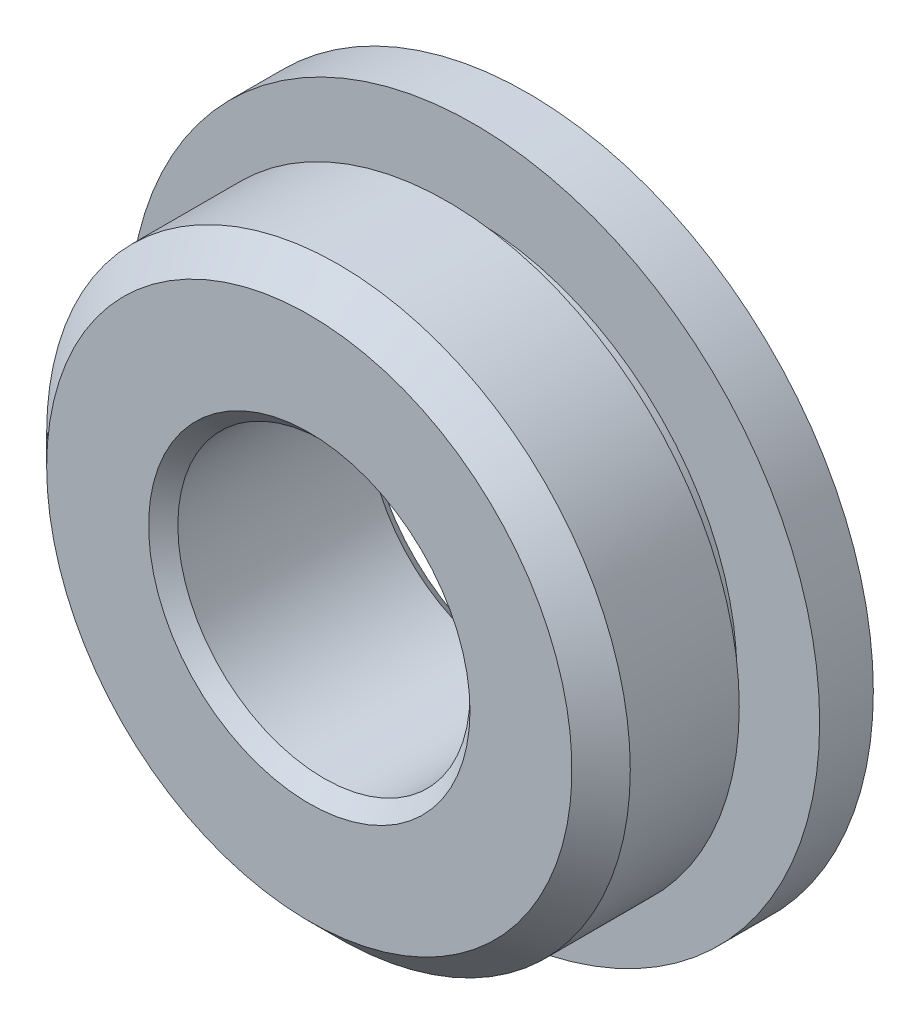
ISO-10303-21;
HEADER;
FILE_DESCRIPTION(('STEP AP214'),'2;1');
FILE_NAME('part.step','',(''),(''),'','','');
FILE_SCHEMA(('AUTOMOTIVE_DESIGN { 1 0 10303 214 1 1 1 1 }'));
ENDSEC;
DATA;
#1=APPLICATION_CONTEXT('core data for automotive mechanical design processes');
#2=APPLICATION_PROTOCOL_DEFINITION('international standard','automotive_design',2000,#1);
#3=PRODUCT_CONTEXT('',#1,'mechanical');
#4=PRODUCT('Part','Part','',(#3));
#5=PRODUCT_RELATED_PRODUCT_CATEGORY('part','',(#4));
#6=PRODUCT_DEFINITION_FORMATION('','',#4);
#7=PRODUCT_DEFINITION_CONTEXT('part definition',#1,'design');
#8=PRODUCT_DEFINITION('design','',#6,#7);
#9=PRODUCT_DEFINITION_SHAPE('','',#8);
#10=(LENGTH_UNIT() NAMED_UNIT(*) SI_UNIT(.MILLI.,.METRE.));
#11=(NAMED_UNIT(*) PLANE_ANGLE_UNIT() SI_UNIT($,.RADIAN.));
#12=(NAMED_UNIT(*) SI_UNIT($,.STERADIAN.) SOLID_ANGLE_UNIT());
#13=UNCERTAINTY_MEASURE_WITH_UNIT(LENGTH_MEASURE(1.E-05),#10,'distance_accuracy_value','');
#14=(GEOMETRIC_REPRESENTATION_CONTEXT(3) GLOBAL_UNCERTAINTY_ASSIGNED_CONTEXT((#13)) GLOBAL_UNIT_ASSIGNED_CONTEXT((#10,
#11,#12)) REPRESENTATION_CONTEXT('',''));
#15=CARTESIAN_POINT('',(0.,0.,0.));
#16=DIRECTION('',(0.,0.,1.));
#17=DIRECTION('',(1.,0.,0.));
#18=AXIS2_PLACEMENT_3D('',#15,#16,#17);
#19=CARTESIAN_POINT('',(0.,0.,-0.118999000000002));
#20=DIRECTION('',(0.,0.,1.));
#21=DIRECTION('',(1.,0.,0.));
#22=AXIS2_PLACEMENT_3D('',#19,#20,#21);
#23=CYLINDRICAL_SURFACE('',#22,3.17627);
#24=CARTESIAN_POINT('',(0.,0.,2.062353));
#25=DIRECTION('',(0.,0.,-1.));
#26=DIRECTION('',(0.,1.,0.));
#27=AXIS2_PLACEMENT_3D('',#24,#25,#26);
#28=CIRCLE('',#27,3.17627);
#29=CARTESIAN_POINT('',(0.,3.17626999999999,2.062353));
#30=VERTEX_POINT('',#29);
#31=EDGE_CURVE('E29',#30,#30,#28,.F.);
#32=ORIENTED_EDGE('',*,*,#31,.F.);
#33=EDGE_LOOP('',(#32));
#34=FACE_BOUND('',#33,.T.);
#35=CARTESIAN_POINT('',(0.,0.,0.8763));
#36=DIRECTION('',(0.,0.,1.));
#37=DIRECTION('',(1.,0.,0.));
#38=AXIS2_PLACEMENT_3D('',#35,#36,#37);
#39=CIRCLE('',#38,3.17627);
#40=CARTESIAN_POINT('',(3.17627,0.,0.8763));
#41=VERTEX_POINT('',#40);
#42=EDGE_CURVE('E17',#41,#41,#39,.T.);
#43=ORIENTED_EDGE('',*,*,#42,.T.);
#44=EDGE_LOOP('',(#43));
#45=FACE_BOUND('',#44,.T.);
#46=ADVANCED_FACE('F14',(#34,#45),#23,.T.);
#47=CARTESIAN_POINT('',(0.,0.,2.062353));
#48=DIRECTION('',(0.,0.,-1.));
#49=DIRECTION('',(-1.,0.,0.));
#50=AXIS2_PLACEMENT_3D('',#47,#48,#49);
#51=CONICAL_SURFACE('',#50,3.17626999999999,0.785398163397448);
#52=CARTESIAN_POINT('',(0.,0.,2.37998));
#53=DIRECTION('',(0.,0.,-1.));
#54=DIRECTION('',(-1.,0.,0.));
#55=AXIS2_PLACEMENT_3D('',#52,#53,#54);
#56=CIRCLE('',#55,2.858643);
#57=CARTESIAN_POINT('',(-2.858643,0.,2.37998));
#58=VERTEX_POINT('',#57);
#59=EDGE_CURVE('E44',#58,#58,#56,.F.);
#60=ORIENTED_EDGE('',*,*,#59,.F.);
#61=EDGE_LOOP('',(#60));
#62=FACE_BOUND('',#61,.T.);
#63=ORIENTED_EDGE('',*,*,#31,.T.);
#64=EDGE_LOOP('',(#63));
#65=FACE_BOUND('',#64,.T.);
#66=ADVANCED_FACE('F54',(#62,#65),#51,.T.);
#67=CARTESIAN_POINT('',(0.,0.,0.8763));
#68=DIRECTION('',(0.,0.,1.));
#69=DIRECTION('',(1.,0.,0.));
#70=AXIS2_PLACEMENT_3D('',#67,#68,#69);
#71=PLANE('',#70);
#72=CARTESIAN_POINT('',(0.,0.,0.8763));
#73=DIRECTION('',(0.,0.,1.));
#74=DIRECTION('',(1.,0.,0.));
#75=AXIS2_PLACEMENT_3D('',#72,#73,#74);
#76=CIRCLE('',#75,2.858643);
#77=CARTESIAN_POINT('',(2.858643,0.,0.8763));
#78=VERTEX_POINT('',#77);
#79=EDGE_CURVE('E42',#78,#78,#76,.F.);
#80=ORIENTED_EDGE('',*,*,#79,.F.);
#81=EDGE_LOOP('',(#80));
#82=FACE_BOUND('',#81,.T.);
#83=ORIENTED_EDGE('',*,*,#42,.F.);
#84=EDGE_LOOP('',(#83));
#85=FACE_BOUND('',#84,.T.);
#86=ADVANCED_FACE('F61',(#82,#85),#71,.F.);
#87=CARTESIAN_POINT('',(0.,0.,2.37998));
#88=DIRECTION('',(0.,0.,1.));
#89=DIRECTION('',(1.,0.,0.));
#90=AXIS2_PLACEMENT_3D('',#87,#88,#89);
#91=PLANE('',#90);
#92=CARTESIAN_POINT('',(0.,0.,2.37998));
#93=DIRECTION('',(0.,0.,1.));
#94=DIRECTION('',(1.,0.,0.));
#95=AXIS2_PLACEMENT_3D('',#92,#93,#94);
#96=CIRCLE('',#95,1.749044);
#97=CARTESIAN_POINT('',(1.749044,0.,2.37998));
#98=VERTEX_POINT('',#97);
#99=EDGE_CURVE('E39',#98,#98,#96,.F.);
#100=ORIENTED_EDGE('',*,*,#99,.T.);
#101=EDGE_LOOP('',(#100));
#102=FACE_BOUND('',#101,.T.);
#103=ORIENTED_EDGE('',*,*,#59,.T.);
#104=EDGE_LOOP('',(#103));
#105=FACE_BOUND('',#104,.T.);
#106=ADVANCED_FACE('F93',(#102,#105),#91,.T.);
#107=CARTESIAN_POINT('',(0.,0.,-0.118999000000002));
#108=DIRECTION('',(0.,0.,1.));
#109=DIRECTION('',(1.,0.,0.));
#110=AXIS2_PLACEMENT_3D('',#107,#108,#109);
#111=CYLINDRICAL_SURFACE('',#110,2.858643);
#112=CARTESIAN_POINT('',(0.,0.,0.5842));
#113=DIRECTION('',(0.,0.,1.));
#114=DIRECTION('',(1.,0.,0.));
#115=AXIS2_PLACEMENT_3D('',#112,#113,#114);
#116=CIRCLE('',#115,2.858643);
#117=CARTESIAN_POINT('',(2.858643,0.,0.5842));
#118=VERTEX_POINT('',#117);
#119=EDGE_CURVE('E36',#118,#118,#116,.F.);
#120=ORIENTED_EDGE('',*,*,#119,.F.);
#121=EDGE_LOOP('',(#120));
#122=FACE_BOUND('',#121,.T.);
#123=ORIENTED_EDGE('',*,*,#79,.T.);
#124=EDGE_LOOP('',(#123));
#125=FACE_BOUND('',#124,.T.);
#126=ADVANCED_FACE('F89',(#122,#125),#111,.T.);
#127=CARTESIAN_POINT('',(0.,0.,2.37998));
#128=DIRECTION('',(0.,0.,1.));
#129=DIRECTION('',(1.,0.,0.));
#130=AXIS2_PLACEMENT_3D('',#127,#128,#129);
#131=CONICAL_SURFACE('',#130,1.749044,0.785398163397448);
#132=CARTESIAN_POINT('',(0.,0.,2.220976));
#133=DIRECTION('',(0.,0.,1.));
#134=DIRECTION('',(1.,0.,0.));
#135=AXIS2_PLACEMENT_3D('',#132,#133,#134);
#136=CIRCLE('',#135,1.59004);
#137=CARTESIAN_POINT('',(1.59004,0.,2.220976));
#138=VERTEX_POINT('',#137);
#139=EDGE_CURVE('E35',#138,#138,#136,.F.);
#140=ORIENTED_EDGE('',*,*,#139,.T.);
#141=EDGE_LOOP('',(#140));
#142=FACE_BOUND('',#141,.T.);
#143=ORIENTED_EDGE('',*,*,#99,.F.);
#144=EDGE_LOOP('',(#143));
#145=FACE_BOUND('',#144,.T.);
#146=ADVANCED_FACE('F85',(#142,#145),#131,.F.);
#147=CARTESIAN_POINT('',(0.,0.,0.5842));
#148=DIRECTION('',(0.,0.,1.));
#149=DIRECTION('',(1.,0.,0.));
#150=AXIS2_PLACEMENT_3D('',#147,#148,#149);
#151=PLANE('',#150);
#152=ORIENTED_EDGE('',*,*,#119,.T.);
#153=EDGE_LOOP('',(#152));
#154=FACE_BOUND('',#153,.T.);
#155=CARTESIAN_POINT('',(0.,0.,0.5842));
#156=DIRECTION('',(0.,0.,1.));
#157=DIRECTION('',(1.,0.,0.));
#158=AXIS2_PLACEMENT_3D('',#155,#156,#157);
#159=CIRCLE('',#158,3.7592);
#160=CARTESIAN_POINT('',(3.7592,0.,0.5842));
#161=VERTEX_POINT('',#160);
#162=EDGE_CURVE('E32',#161,#161,#159,.F.);
#163=ORIENTED_EDGE('',*,*,#162,.F.);
#164=EDGE_LOOP('',(#163));
#165=FACE_BOUND('',#164,.T.);
#166=ADVANCED_FACE('F81',(#154,#165),#151,.T.);
#167=CARTESIAN_POINT('',(0.,0.,-0.118999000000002));
#168=DIRECTION('',(0.,0.,1.));
#169=DIRECTION('',(1.,0.,0.));
#170=AXIS2_PLACEMENT_3D('',#167,#168,#169);
#171=CYLINDRICAL_SURFACE('',#170,1.59004);
#172=ORIENTED_EDGE('',*,*,#139,.F.);
#173=EDGE_LOOP('',(#172));
#174=FACE_BOUND('',#173,.T.);
#175=CARTESIAN_POINT('',(0.,0.,0.159004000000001));
#176=DIRECTION('',(0.,0.,-1.));
#177=DIRECTION('',(0.,1.,0.));
#178=AXIS2_PLACEMENT_3D('',#175,#176,#177);
#179=CIRCLE('',#178,1.59004);
#180=CARTESIAN_POINT('',(0.,1.59004,0.159004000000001));
#181=VERTEX_POINT('',#180);
#182=EDGE_CURVE('E26',#181,#181,#179,.T.);
#183=ORIENTED_EDGE('',*,*,#182,.T.);
#184=EDGE_LOOP('',(#183));
#185=FACE_BOUND('',#184,.T.);
#186=ADVANCED_FACE('F77',(#174,#185),#171,.F.);
#187=CARTESIAN_POINT('',(0.,0.,-0.118999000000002));
#188=DIRECTION('',(0.,0.,1.));
#189=DIRECTION('',(1.,0.,0.));
#190=AXIS2_PLACEMENT_3D('',#187,#188,#189);
#191=CYLINDRICAL_SURFACE('',#190,3.7592);
#192=ORIENTED_EDGE('',*,*,#162,.T.);
#193=EDGE_LOOP('',(#192));
#194=FACE_BOUND('',#193,.T.);
#195=CARTESIAN_POINT('',(0.,0.,0.));
#196=DIRECTION('',(0.,0.,1.));
#197=DIRECTION('',(1.,0.,0.));
#198=AXIS2_PLACEMENT_3D('',#195,#196,#197);
#199=CIRCLE('',#198,3.7592);
#200=CARTESIAN_POINT('',(3.7592,0.,0.));
#201=VERTEX_POINT('',#200);
#202=EDGE_CURVE('E21',#201,#201,#199,.T.);
#203=ORIENTED_EDGE('',*,*,#202,.T.);
#204=EDGE_LOOP('',(#203));
#205=FACE_BOUND('',#204,.T.);
#206=ADVANCED_FACE('F71',(#194,#205),#191,.T.);
#207=CARTESIAN_POINT('',(0.,0.,0.));
#208=DIRECTION('',(0.,0.,-1.));
#209=DIRECTION('',(-1.,0.,0.));
#210=AXIS2_PLACEMENT_3D('',#207,#208,#209);
#211=CONICAL_SURFACE('',#210,1.749044,0.785398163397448);
#212=CARTESIAN_POINT('',(0.,0.,0.));
#213=DIRECTION('',(0.,0.,-1.));
#214=DIRECTION('',(-1.,0.,0.));
#215=AXIS2_PLACEMENT_3D('',#212,#213,#214);
#216=CIRCLE('',#215,1.749044);
#217=CARTESIAN_POINT('',(-1.749044,0.,0.));
#218=VERTEX_POINT('',#217);
#219=EDGE_CURVE('E10',#218,#218,#216,.T.);
#220=ORIENTED_EDGE('',*,*,#219,.T.);
#221=EDGE_LOOP('',(#220));
#222=FACE_BOUND('',#221,.T.);
#223=ORIENTED_EDGE('',*,*,#182,.F.);
#224=EDGE_LOOP('',(#223));
#225=FACE_BOUND('',#224,.T.);
#226=ADVANCED_FACE('F65',(#222,#225),#211,.F.);
#227=CARTESIAN_POINT('',(0.,0.,0.));
#228=DIRECTION('',(0.,0.,1.));
#229=DIRECTION('',(1.,0.,0.));
#230=AXIS2_PLACEMENT_3D('',#227,#228,#229);
#231=PLANE('',#230);
#232=ORIENTED_EDGE('',*,*,#219,.F.);
#233=EDGE_LOOP('',(#232));
#234=FACE_BOUND('',#233,.T.);
#235=ORIENTED_EDGE('',*,*,#202,.F.);
#236=EDGE_LOOP('',(#235));
#237=FACE_BOUND('',#236,.T.);
#238=ADVANCED_FACE('F63',(#234,#237),#231,.F.);
#239=CLOSED_SHELL('',(#46,#66,#86,#106,#126,#146,#166,#186,#206,#226,#238));
#240=MANIFOLD_SOLID_BREP('B1',#239);
#241=ADVANCED_BREP_SHAPE_REPRESENTATION('',(#18,#240),#14);
#242=SHAPE_DEFINITION_REPRESENTATION(#9,#241);
ENDSEC;
END-ISO-10303-21;
